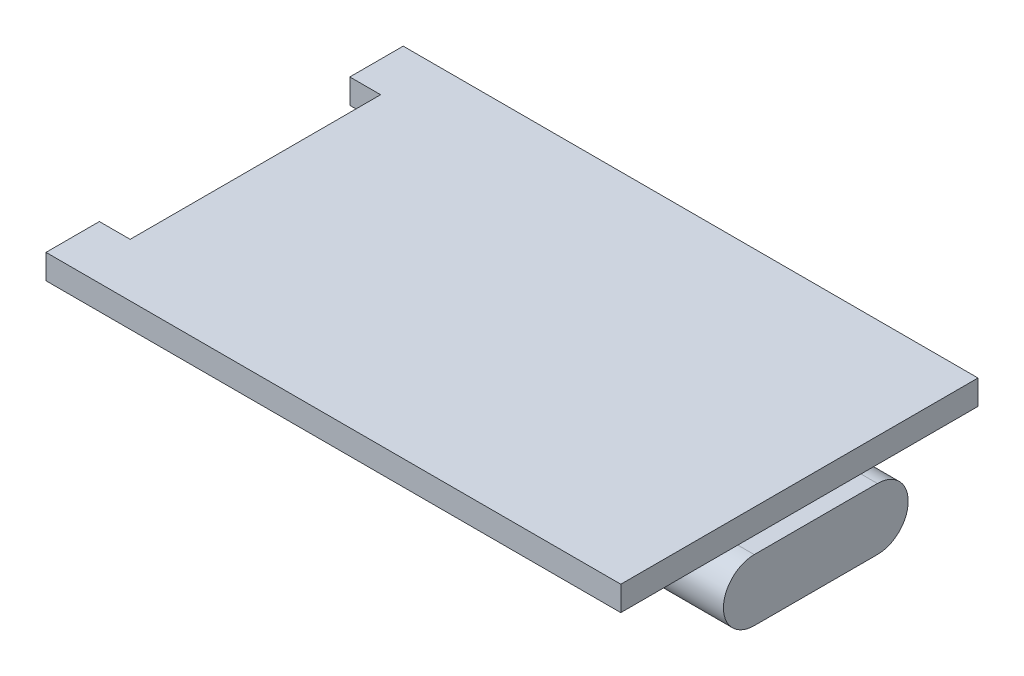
ISO-10303-21;
HEADER;
FILE_DESCRIPTION(('STEP AP214'),'2;1');
FILE_NAME('part.step','',(''),(''),'','','');
FILE_SCHEMA(('AUTOMOTIVE_DESIGN { 1 0 10303 214 1 1 1 1 }'));
ENDSEC;
DATA;
#1=APPLICATION_CONTEXT('core data for automotive mechanical design processes');
#2=APPLICATION_PROTOCOL_DEFINITION('international standard','automotive_design',2000,#1);
#3=PRODUCT_CONTEXT('',#1,'mechanical');
#4=PRODUCT('Part','Part','',(#3));
#5=PRODUCT_RELATED_PRODUCT_CATEGORY('part','',(#4));
#6=PRODUCT_DEFINITION_FORMATION('','',#4);
#7=PRODUCT_DEFINITION_CONTEXT('part definition',#1,'design');
#8=PRODUCT_DEFINITION('design','',#6,#7);
#9=PRODUCT_DEFINITION_SHAPE('','',#8);
#10=(LENGTH_UNIT() NAMED_UNIT(*) SI_UNIT(.MILLI.,.METRE.));
#11=(NAMED_UNIT(*) PLANE_ANGLE_UNIT() SI_UNIT($,.RADIAN.));
#12=(NAMED_UNIT(*) SI_UNIT($,.STERADIAN.) SOLID_ANGLE_UNIT());
#13=UNCERTAINTY_MEASURE_WITH_UNIT(LENGTH_MEASURE(1.E-05),#10,'distance_accuracy_value','');
#14=(GEOMETRIC_REPRESENTATION_CONTEXT(3) GLOBAL_UNCERTAINTY_ASSIGNED_CONTEXT((#13)) GLOBAL_UNIT_ASSIGNED_CONTEXT((#10,
#11,#12)) REPRESENTATION_CONTEXT('',''));
#15=CARTESIAN_POINT('',(0.,0.,0.));
#16=DIRECTION('',(0.,0.,1.));
#17=DIRECTION('',(1.,0.,0.));
#18=AXIS2_PLACEMENT_3D('',#15,#16,#17);
#19=CARTESIAN_POINT('',(-6.8,1.5,3.));
#20=DIRECTION('',(0.,1.,0.));
#21=DIRECTION('',(0.,0.,1.));
#22=AXIS2_PLACEMENT_3D('',#19,#20,#21);
#23=PLANE('',#22);
#24=DIRECTION('',(1.,0.,0.));
#25=VECTOR('',#24,1.);
#26=CARTESIAN_POINT('',(-6.8,1.5,-3.));
#27=LINE('',#26,#25);
#28=CARTESIAN_POINT('',(-0.799999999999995,1.5,-3.));
#29=VERTEX_POINT('',#28);
#30=CARTESIAN_POINT('',(0.,1.5,-3.));
#31=VERTEX_POINT('',#30);
#32=EDGE_CURVE('E65',#29,#31,#27,.T.);
#33=ORIENTED_EDGE('',*,*,#32,.F.);
#34=DIRECTION('',(0.,0.,-1.));
#35=VECTOR('',#34,1.);
#36=CARTESIAN_POINT('',(-0.799999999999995,1.5,-8.7));
#37=LINE('',#36,#35);
#38=CARTESIAN_POINT('',(-0.799999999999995,1.5,3.));
#39=VERTEX_POINT('',#38);
#40=EDGE_CURVE('E60',#39,#29,#37,.T.);
#41=ORIENTED_EDGE('',*,*,#40,.F.);
#42=DIRECTION('',(1.,0.,0.));
#43=VECTOR('',#42,1.);
#44=CARTESIAN_POINT('',(-6.8,1.5,3.));
#45=LINE('',#44,#43);
#46=CARTESIAN_POINT('',(0.,1.5,3.));
#47=VERTEX_POINT('',#46);
#48=EDGE_CURVE('E52',#39,#47,#45,.T.);
#49=ORIENTED_EDGE('',*,*,#48,.T.);
#50=DIRECTION('',(0.,0.,1.));
#51=VECTOR('',#50,1.);
#52=CARTESIAN_POINT('',(0.,1.5,3.));
#53=LINE('',#52,#51);
#54=EDGE_CURVE('E178',#31,#47,#53,.T.);
#55=ORIENTED_EDGE('',*,*,#54,.F.);
#56=EDGE_LOOP('',(#33,#41,#49,#55));
#57=FACE_BOUND('',#56,.T.);
#58=ADVANCED_FACE('F43',(#57),#23,.T.);
#59=CARTESIAN_POINT('',(-6.8,0.,3.));
#60=DIRECTION('',(1.,0.,0.));
#61=DIRECTION('',(0.,0.,-1.));
#62=AXIS2_PLACEMENT_3D('',#59,#60,#61);
#63=CYLINDRICAL_SURFACE('',#62,1.5);
#64=CARTESIAN_POINT('',(0.,0.,3.));
#65=DIRECTION('',(1.,0.,0.));
#66=DIRECTION('',(0.,0.,-1.));
#67=AXIS2_PLACEMENT_3D('',#64,#65,#66);
#68=CIRCLE('',#67,1.5);
#69=CARTESIAN_POINT('',(0.,-1.5,3.));
#70=VERTEX_POINT('',#69);
#71=EDGE_CURVE('E165',#47,#70,#68,.T.);
#72=ORIENTED_EDGE('',*,*,#71,.F.);
#73=ORIENTED_EDGE('',*,*,#48,.F.);
#74=CARTESIAN_POINT('',(-6.8,1.5,3.));
#75=VERTEX_POINT('',#74);
#76=EDGE_CURVE('E11',#75,#39,#45,.T.);
#77=ORIENTED_EDGE('',*,*,#76,.F.);
#78=CARTESIAN_POINT('',(-6.8,0.,3.));
#79=DIRECTION('',(1.,0.,0.));
#80=DIRECTION('',(0.,0.,-1.));
#81=AXIS2_PLACEMENT_3D('',#78,#79,#80);
#82=CIRCLE('',#81,1.5);
#83=CARTESIAN_POINT('',(-6.8,-1.5,3.));
#84=VERTEX_POINT('',#83);
#85=EDGE_CURVE('E174',#75,#84,#82,.T.);
#86=ORIENTED_EDGE('',*,*,#85,.T.);
#87=DIRECTION('',(1.,0.,0.));
#88=VECTOR('',#87,1.);
#89=CARTESIAN_POINT('',(-6.8,-1.5,3.));
#90=LINE('',#89,#88);
#91=EDGE_CURVE('E47',#84,#70,#90,.T.);
#92=ORIENTED_EDGE('',*,*,#91,.T.);
#93=EDGE_LOOP('',(#72,#73,#77,#86,#92));
#94=FACE_BOUND('',#93,.T.);
#95=ADVANCED_FACE('F45',(#94),#63,.T.);
#96=CARTESIAN_POINT('',(-6.8,0.,-3.));
#97=DIRECTION('',(1.,0.,0.));
#98=DIRECTION('',(0.,0.,-1.));
#99=AXIS2_PLACEMENT_3D('',#96,#97,#98);
#100=CYLINDRICAL_SURFACE('',#99,1.5);
#101=CARTESIAN_POINT('',(0.,0.,-3.));
#102=DIRECTION('',(1.,0.,0.));
#103=DIRECTION('',(0.,0.,-1.));
#104=AXIS2_PLACEMENT_3D('',#101,#102,#103);
#105=CIRCLE('',#104,1.5);
#106=CARTESIAN_POINT('',(0.,-1.5,-3.));
#107=VERTEX_POINT('',#106);
#108=EDGE_CURVE('E188',#107,#31,#105,.T.);
#109=ORIENTED_EDGE('',*,*,#108,.F.);
#110=DIRECTION('',(1.,0.,0.));
#111=VECTOR('',#110,1.);
#112=CARTESIAN_POINT('',(-6.8,-1.5,-3.));
#113=LINE('',#112,#111);
#114=CARTESIAN_POINT('',(-6.8,-1.5,-3.));
#115=VERTEX_POINT('',#114);
#116=EDGE_CURVE('E194',#115,#107,#113,.T.);
#117=ORIENTED_EDGE('',*,*,#116,.F.);
#118=CARTESIAN_POINT('',(-6.8,0.,-3.));
#119=DIRECTION('',(1.,0.,0.));
#120=DIRECTION('',(0.,0.,-1.));
#121=AXIS2_PLACEMENT_3D('',#118,#119,#120);
#122=CIRCLE('',#121,1.5);
#123=CARTESIAN_POINT('',(-6.8,1.5,-3.));
#124=VERTEX_POINT('',#123);
#125=EDGE_CURVE('E181',#115,#124,#122,.T.);
#126=ORIENTED_EDGE('',*,*,#125,.T.);
#127=EDGE_CURVE('E193',#124,#29,#27,.T.);
#128=ORIENTED_EDGE('',*,*,#127,.T.);
#129=ORIENTED_EDGE('',*,*,#32,.T.);
#130=EDGE_LOOP('',(#109,#117,#126,#128,#129));
#131=FACE_BOUND('',#130,.T.);
#132=ADVANCED_FACE('F285',(#131),#100,.T.);
#133=CARTESIAN_POINT('',(-6.8,-1.5,3.));
#134=DIRECTION('',(0.,-1.,0.));
#135=DIRECTION('',(0.,0.,-1.));
#136=AXIS2_PLACEMENT_3D('',#133,#134,#135);
#137=PLANE('',#136);
#138=DIRECTION('',(0.,0.,-1.));
#139=VECTOR('',#138,1.);
#140=CARTESIAN_POINT('',(0.,-1.5,3.));
#141=LINE('',#140,#139);
#142=EDGE_CURVE('E168',#70,#107,#141,.T.);
#143=ORIENTED_EDGE('',*,*,#142,.F.);
#144=ORIENTED_EDGE('',*,*,#91,.F.);
#145=DIRECTION('',(0.,0.,-1.));
#146=VECTOR('',#145,1.);
#147=CARTESIAN_POINT('',(-6.8,-1.5,3.));
#148=LINE('',#147,#146);
#149=EDGE_CURVE('E177',#84,#115,#148,.T.);
#150=ORIENTED_EDGE('',*,*,#149,.T.);
#151=ORIENTED_EDGE('',*,*,#116,.T.);
#152=EDGE_LOOP('',(#143,#144,#150,#151));
#153=FACE_BOUND('',#152,.T.);
#154=ADVANCED_FACE('F202',(#153),#137,.T.);
#155=CARTESIAN_POINT('',(-6.8,0.,3.));
#156=DIRECTION('',(1.,0.,0.));
#157=DIRECTION('',(0.,0.,-1.));
#158=AXIS2_PLACEMENT_3D('',#155,#156,#157);
#159=PLANE('',#158);
#160=ORIENTED_EDGE('',*,*,#85,.F.);
#161=DIRECTION('',(0.,0.,1.));
#162=VECTOR('',#161,1.);
#163=CARTESIAN_POINT('',(-6.8,1.5,3.));
#164=LINE('',#163,#162);
#165=EDGE_CURVE('E183',#124,#75,#164,.T.);
#166=ORIENTED_EDGE('',*,*,#165,.F.);
#167=ORIENTED_EDGE('',*,*,#125,.F.);
#168=ORIENTED_EDGE('',*,*,#149,.F.);
#169=EDGE_LOOP('',(#160,#166,#167,#168));
#170=FACE_BOUND('',#169,.T.);
#171=ADVANCED_FACE('F292',(#170),#159,.F.);
#172=CARTESIAN_POINT('',(0.,0.,3.));
#173=DIRECTION('',(1.,0.,0.));
#174=DIRECTION('',(0.,0.,-1.));
#175=AXIS2_PLACEMENT_3D('',#172,#173,#174);
#176=PLANE('',#175);
#177=ORIENTED_EDGE('',*,*,#71,.T.);
#178=ORIENTED_EDGE('',*,*,#142,.T.);
#179=ORIENTED_EDGE('',*,*,#108,.T.);
#180=ORIENTED_EDGE('',*,*,#54,.T.);
#181=EDGE_LOOP('',(#177,#178,#179,#180));
#182=FACE_BOUND('',#181,.T.);
#183=ADVANCED_FACE('F204',(#182),#176,.T.);
#184=CARTESIAN_POINT('',(-0.799999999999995,2.7,-8.7));
#185=DIRECTION('',(-1.,0.,0.));
#186=DIRECTION('',(0.,0.,1.));
#187=AXIS2_PLACEMENT_3D('',#184,#185,#186);
#188=PLANE('',#187);
#189=CARTESIAN_POINT('',(-0.799999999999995,1.5,8.7));
#190=VERTEX_POINT('',#189);
#191=EDGE_CURVE('E209',#190,#39,#37,.T.);
#192=ORIENTED_EDGE('',*,*,#191,.T.);
#193=ORIENTED_EDGE('',*,*,#40,.T.);
#194=CARTESIAN_POINT('',(-0.799999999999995,1.5,-8.7));
#195=VERTEX_POINT('',#194);
#196=EDGE_CURVE('E163',#29,#195,#37,.T.);
#197=ORIENTED_EDGE('',*,*,#196,.T.);
#198=DIRECTION('',(0.,-1.,0.));
#199=VECTOR('',#198,1.);
#200=CARTESIAN_POINT('',(-0.799999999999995,2.7,-8.7));
#201=LINE('',#200,#199);
#202=CARTESIAN_POINT('',(-0.799999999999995,2.7,-8.7));
#203=VERTEX_POINT('',#202);
#204=EDGE_CURVE('E143',#203,#195,#201,.T.);
#205=ORIENTED_EDGE('',*,*,#204,.F.);
#206=DIRECTION('',(0.,0.,-1.));
#207=VECTOR('',#206,1.);
#208=CARTESIAN_POINT('',(-0.799999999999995,2.7,-8.7));
#209=LINE('',#208,#207);
#210=CARTESIAN_POINT('',(-0.799999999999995,2.7,8.7));
#211=VERTEX_POINT('',#210);
#212=EDGE_CURVE('E149',#211,#203,#209,.T.);
#213=ORIENTED_EDGE('',*,*,#212,.F.);
#214=DIRECTION('',(0.,-1.,0.));
#215=VECTOR('',#214,1.);
#216=CARTESIAN_POINT('',(-0.799999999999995,2.7,8.7));
#217=LINE('',#216,#215);
#218=EDGE_CURVE('E212',#211,#190,#217,.T.);
#219=ORIENTED_EDGE('',*,*,#218,.T.);
#220=EDGE_LOOP('',(#192,#193,#197,#205,#213,#219));
#221=FACE_BOUND('',#220,.T.);
#222=ADVANCED_FACE('F161',(#221),#188,.F.);
#223=CARTESIAN_POINT('',(-28.8,2.7,-8.7));
#224=DIRECTION('',(0.,0.,1.));
#225=DIRECTION('',(0.,-1.,0.));
#226=AXIS2_PLACEMENT_3D('',#223,#224,#225);
#227=PLANE('',#226);
#228=DIRECTION('',(-1.,0.,0.));
#229=VECTOR('',#228,1.);
#230=CARTESIAN_POINT('',(-28.8,1.5,-8.7));
#231=LINE('',#230,#229);
#232=CARTESIAN_POINT('',(-28.8,1.5,-8.7));
#233=VERTEX_POINT('',#232);
#234=EDGE_CURVE('E213',#195,#233,#231,.T.);
#235=ORIENTED_EDGE('',*,*,#234,.T.);
#236=DIRECTION('',(0.,-1.,0.));
#237=VECTOR('',#236,1.);
#238=CARTESIAN_POINT('',(-28.8,2.7,-8.7));
#239=LINE('',#238,#237);
#240=CARTESIAN_POINT('',(-28.8,2.7,-8.7));
#241=VERTEX_POINT('',#240);
#242=EDGE_CURVE('E145',#241,#233,#239,.T.);
#243=ORIENTED_EDGE('',*,*,#242,.F.);
#244=DIRECTION('',(-1.,0.,0.));
#245=VECTOR('',#244,1.);
#246=CARTESIAN_POINT('',(-28.8,2.7,-8.7));
#247=LINE('',#246,#245);
#248=EDGE_CURVE('E139',#203,#241,#247,.T.);
#249=ORIENTED_EDGE('',*,*,#248,.F.);
#250=ORIENTED_EDGE('',*,*,#204,.T.);
#251=EDGE_LOOP('',(#235,#243,#249,#250));
#252=FACE_BOUND('',#251,.T.);
#253=ADVANCED_FACE('F141',(#252),#227,.F.);
#254=CARTESIAN_POINT('',(-28.8,2.7,-8.7));
#255=DIRECTION('',(1.,0.,0.));
#256=DIRECTION('',(0.,0.,-1.));
#257=AXIS2_PLACEMENT_3D('',#254,#255,#256);
#258=PLANE('',#257);
#259=DIRECTION('',(0.,0.,1.));
#260=VECTOR('',#259,1.);
#261=CARTESIAN_POINT('',(-28.8,1.5,-8.7));
#262=LINE('',#261,#260);
#263=CARTESIAN_POINT('',(-28.8,1.5,-6.1));
#264=VERTEX_POINT('',#263);
#265=EDGE_CURVE('E215',#233,#264,#262,.T.);
#266=ORIENTED_EDGE('',*,*,#265,.T.);
#267=DIRECTION('',(0.,-1.,0.));
#268=VECTOR('',#267,1.);
#269=CARTESIAN_POINT('',(-28.8,2.7,-6.1));
#270=LINE('',#269,#268);
#271=CARTESIAN_POINT('',(-28.8,2.7,-6.1));
#272=VERTEX_POINT('',#271);
#273=EDGE_CURVE('E170',#272,#264,#270,.T.);
#274=ORIENTED_EDGE('',*,*,#273,.F.);
#275=DIRECTION('',(0.,0.,1.));
#276=VECTOR('',#275,1.);
#277=CARTESIAN_POINT('',(-28.8,2.7,-8.7));
#278=LINE('',#277,#276);
#279=EDGE_CURVE('E148',#241,#272,#278,.T.);
#280=ORIENTED_EDGE('',*,*,#279,.F.);
#281=ORIENTED_EDGE('',*,*,#242,.T.);
#282=EDGE_LOOP('',(#266,#274,#280,#281));
#283=FACE_BOUND('',#282,.T.);
#284=ADVANCED_FACE('F271',(#283),#258,.F.);
#285=CARTESIAN_POINT('',(-28.8,2.7,-6.1));
#286=DIRECTION('',(0.,0.,-1.));
#287=DIRECTION('',(-1.,0.,0.));
#288=AXIS2_PLACEMENT_3D('',#285,#286,#287);
#289=PLANE('',#288);
#290=DIRECTION('',(1.,0.,0.));
#291=VECTOR('',#290,1.);
#292=CARTESIAN_POINT('',(-28.8,1.5,-6.1));
#293=LINE('',#292,#291);
#294=CARTESIAN_POINT('',(-27.3,1.5,-6.1));
#295=VERTEX_POINT('',#294);
#296=EDGE_CURVE('E221',#264,#295,#293,.T.);
#297=ORIENTED_EDGE('',*,*,#296,.T.);
#298=DIRECTION('',(0.,-1.,0.));
#299=VECTOR('',#298,1.);
#300=CARTESIAN_POINT('',(-27.3,2.7,-6.1));
#301=LINE('',#300,#299);
#302=CARTESIAN_POINT('',(-27.3,2.7,-6.1));
#303=VERTEX_POINT('',#302);
#304=EDGE_CURVE('E240',#303,#295,#301,.T.);
#305=ORIENTED_EDGE('',*,*,#304,.F.);
#306=DIRECTION('',(1.,0.,0.));
#307=VECTOR('',#306,1.);
#308=CARTESIAN_POINT('',(-28.8,2.7,-6.1));
#309=LINE('',#308,#307);
#310=EDGE_CURVE('E249',#272,#303,#309,.T.);
#311=ORIENTED_EDGE('',*,*,#310,.F.);
#312=ORIENTED_EDGE('',*,*,#273,.T.);
#313=EDGE_LOOP('',(#297,#305,#311,#312));
#314=FACE_BOUND('',#313,.T.);
#315=ADVANCED_FACE('F247',(#314),#289,.F.);
#316=CARTESIAN_POINT('',(-27.3,2.7,-6.1));
#317=DIRECTION('',(1.,0.,0.));
#318=DIRECTION('',(0.,0.,-1.));
#319=AXIS2_PLACEMENT_3D('',#316,#317,#318);
#320=PLANE('',#319);
#321=DIRECTION('',(0.,0.,1.));
#322=VECTOR('',#321,1.);
#323=CARTESIAN_POINT('',(-27.3,1.5,-6.1));
#324=LINE('',#323,#322);
#325=CARTESIAN_POINT('',(-27.3,1.5,6.1));
#326=VERTEX_POINT('',#325);
#327=EDGE_CURVE('E223',#295,#326,#324,.T.);
#328=ORIENTED_EDGE('',*,*,#327,.T.);
#329=DIRECTION('',(0.,-1.,0.));
#330=VECTOR('',#329,1.);
#331=CARTESIAN_POINT('',(-27.3,2.7,6.1));
#332=LINE('',#331,#330);
#333=CARTESIAN_POINT('',(-27.3,2.7,6.1));
#334=VERTEX_POINT('',#333);
#335=EDGE_CURVE('E237',#334,#326,#332,.T.);
#336=ORIENTED_EDGE('',*,*,#335,.F.);
#337=DIRECTION('',(0.,0.,1.));
#338=VECTOR('',#337,1.);
#339=CARTESIAN_POINT('',(-27.3,2.7,-6.1));
#340=LINE('',#339,#338);
#341=EDGE_CURVE('E266',#303,#334,#340,.T.);
#342=ORIENTED_EDGE('',*,*,#341,.F.);
#343=ORIENTED_EDGE('',*,*,#304,.T.);
#344=EDGE_LOOP('',(#328,#336,#342,#343));
#345=FACE_BOUND('',#344,.T.);
#346=ADVANCED_FACE('F257',(#345),#320,.F.);
#347=CARTESIAN_POINT('',(-28.8,2.7,6.1));
#348=DIRECTION('',(0.,0.,1.));
#349=DIRECTION('',(1.,0.,0.));
#350=AXIS2_PLACEMENT_3D('',#347,#348,#349);
#351=PLANE('',#350);
#352=DIRECTION('',(-1.,0.,0.));
#353=VECTOR('',#352,1.);
#354=CARTESIAN_POINT('',(-28.8,1.5,6.1));
#355=LINE('',#354,#353);
#356=CARTESIAN_POINT('',(-28.8,1.5,6.1));
#357=VERTEX_POINT('',#356);
#358=EDGE_CURVE('E225',#326,#357,#355,.T.);
#359=ORIENTED_EDGE('',*,*,#358,.T.);
#360=DIRECTION('',(0.,-1.,0.));
#361=VECTOR('',#360,1.);
#362=CARTESIAN_POINT('',(-28.8,2.7,6.1));
#363=LINE('',#362,#361);
#364=CARTESIAN_POINT('',(-28.8,2.7,6.1));
#365=VERTEX_POINT('',#364);
#366=EDGE_CURVE('E234',#365,#357,#363,.T.);
#367=ORIENTED_EDGE('',*,*,#366,.F.);
#368=DIRECTION('',(-1.,0.,0.));
#369=VECTOR('',#368,1.);
#370=CARTESIAN_POINT('',(-28.8,2.7,6.1));
#371=LINE('',#370,#369);
#372=EDGE_CURVE('E263',#334,#365,#371,.T.);
#373=ORIENTED_EDGE('',*,*,#372,.F.);
#374=ORIENTED_EDGE('',*,*,#335,.T.);
#375=EDGE_LOOP('',(#359,#367,#373,#374));
#376=FACE_BOUND('',#375,.T.);
#377=ADVANCED_FACE('F261',(#376),#351,.F.);
#378=CARTESIAN_POINT('',(-28.8,2.7,6.1));
#379=DIRECTION('',(1.,0.,0.));
#380=DIRECTION('',(0.,0.,-1.));
#381=AXIS2_PLACEMENT_3D('',#378,#379,#380);
#382=PLANE('',#381);
#383=DIRECTION('',(0.,0.,1.));
#384=VECTOR('',#383,1.);
#385=CARTESIAN_POINT('',(-28.8,1.5,6.1));
#386=LINE('',#385,#384);
#387=CARTESIAN_POINT('',(-28.8,1.5,8.7));
#388=VERTEX_POINT('',#387);
#389=EDGE_CURVE('E227',#357,#388,#386,.T.);
#390=ORIENTED_EDGE('',*,*,#389,.T.);
#391=DIRECTION('',(0.,-1.,0.));
#392=VECTOR('',#391,1.);
#393=CARTESIAN_POINT('',(-28.8,2.7,8.7));
#394=LINE('',#393,#392);
#395=CARTESIAN_POINT('',(-28.8,2.7,8.7));
#396=VERTEX_POINT('',#395);
#397=EDGE_CURVE('E231',#396,#388,#394,.T.);
#398=ORIENTED_EDGE('',*,*,#397,.F.);
#399=DIRECTION('',(0.,0.,1.));
#400=VECTOR('',#399,1.);
#401=CARTESIAN_POINT('',(-28.8,2.7,6.1));
#402=LINE('',#401,#400);
#403=EDGE_CURVE('E265',#365,#396,#402,.T.);
#404=ORIENTED_EDGE('',*,*,#403,.F.);
#405=ORIENTED_EDGE('',*,*,#366,.T.);
#406=EDGE_LOOP('',(#390,#398,#404,#405));
#407=FACE_BOUND('',#406,.T.);
#408=ADVANCED_FACE('F332',(#407),#382,.F.);
#409=CARTESIAN_POINT('',(-28.8,2.7,8.7));
#410=DIRECTION('',(0.,0.,-1.));
#411=DIRECTION('',(0.,1.,0.));
#412=AXIS2_PLACEMENT_3D('',#409,#410,#411);
#413=PLANE('',#412);
#414=DIRECTION('',(1.,0.,0.));
#415=VECTOR('',#414,1.);
#416=CARTESIAN_POINT('',(-28.8,1.5,8.7));
#417=LINE('',#416,#415);
#418=EDGE_CURVE('E158',#388,#190,#417,.T.);
#419=ORIENTED_EDGE('',*,*,#418,.T.);
#420=ORIENTED_EDGE('',*,*,#218,.F.);
#421=DIRECTION('',(1.,0.,0.));
#422=VECTOR('',#421,1.);
#423=CARTESIAN_POINT('',(-28.8,2.7,8.7));
#424=LINE('',#423,#422);
#425=EDGE_CURVE('E154',#396,#211,#424,.T.);
#426=ORIENTED_EDGE('',*,*,#425,.F.);
#427=ORIENTED_EDGE('',*,*,#397,.T.);
#428=EDGE_LOOP('',(#419,#420,#426,#427));
#429=FACE_BOUND('',#428,.T.);
#430=ADVANCED_FACE('F339',(#429),#413,.F.);
#431=CARTESIAN_POINT('',(0.,2.7,0.));
#432=DIRECTION('',(0.,1.,0.));
#433=DIRECTION('',(0.,0.,1.));
#434=AXIS2_PLACEMENT_3D('',#431,#432,#433);
#435=PLANE('',#434);
#436=ORIENTED_EDGE('',*,*,#212,.T.);
#437=ORIENTED_EDGE('',*,*,#248,.T.);
#438=ORIENTED_EDGE('',*,*,#279,.T.);
#439=ORIENTED_EDGE('',*,*,#310,.T.);
#440=ORIENTED_EDGE('',*,*,#341,.T.);
#441=ORIENTED_EDGE('',*,*,#372,.T.);
#442=ORIENTED_EDGE('',*,*,#403,.T.);
#443=ORIENTED_EDGE('',*,*,#425,.T.);
#444=EDGE_LOOP('',(#436,#437,#438,#439,#440,#441,#442,#443));
#445=FACE_BOUND('',#444,.T.);
#446=ADVANCED_FACE('F152',(#445),#435,.T.);
#447=CARTESIAN_POINT('',(0.,1.5,0.));
#448=DIRECTION('',(0.,1.,0.));
#449=DIRECTION('',(0.,0.,1.));
#450=AXIS2_PLACEMENT_3D('',#447,#448,#449);
#451=PLANE('',#450);
#452=ORIENTED_EDGE('',*,*,#76,.T.);
#453=ORIENTED_EDGE('',*,*,#191,.F.);
#454=ORIENTED_EDGE('',*,*,#418,.F.);
#455=ORIENTED_EDGE('',*,*,#389,.F.);
#456=ORIENTED_EDGE('',*,*,#358,.F.);
#457=ORIENTED_EDGE('',*,*,#327,.F.);
#458=ORIENTED_EDGE('',*,*,#296,.F.);
#459=ORIENTED_EDGE('',*,*,#265,.F.);
#460=ORIENTED_EDGE('',*,*,#234,.F.);
#461=ORIENTED_EDGE('',*,*,#196,.F.);
#462=ORIENTED_EDGE('',*,*,#127,.F.);
#463=ORIENTED_EDGE('',*,*,#165,.T.);
#464=EDGE_LOOP('',(#452,#453,#454,#455,#456,#457,#458,#459,#460,#461,#462,#463));
#465=FACE_BOUND('',#464,.T.);
#466=ADVANCED_FACE('F207',(#465),#451,.F.);
#467=CLOSED_SHELL('',(#58,#95,#132,#154,#171,#183,#222,#253,#284,#315,#346,#377,#408,#430,#446,#466));
#468=MANIFOLD_SOLID_BREP('B2',#467);
#469=ADVANCED_BREP_SHAPE_REPRESENTATION('',(#18,#468),#14);
#470=SHAPE_DEFINITION_REPRESENTATION(#9,#469);
ENDSEC;
END-ISO-10303-21;
